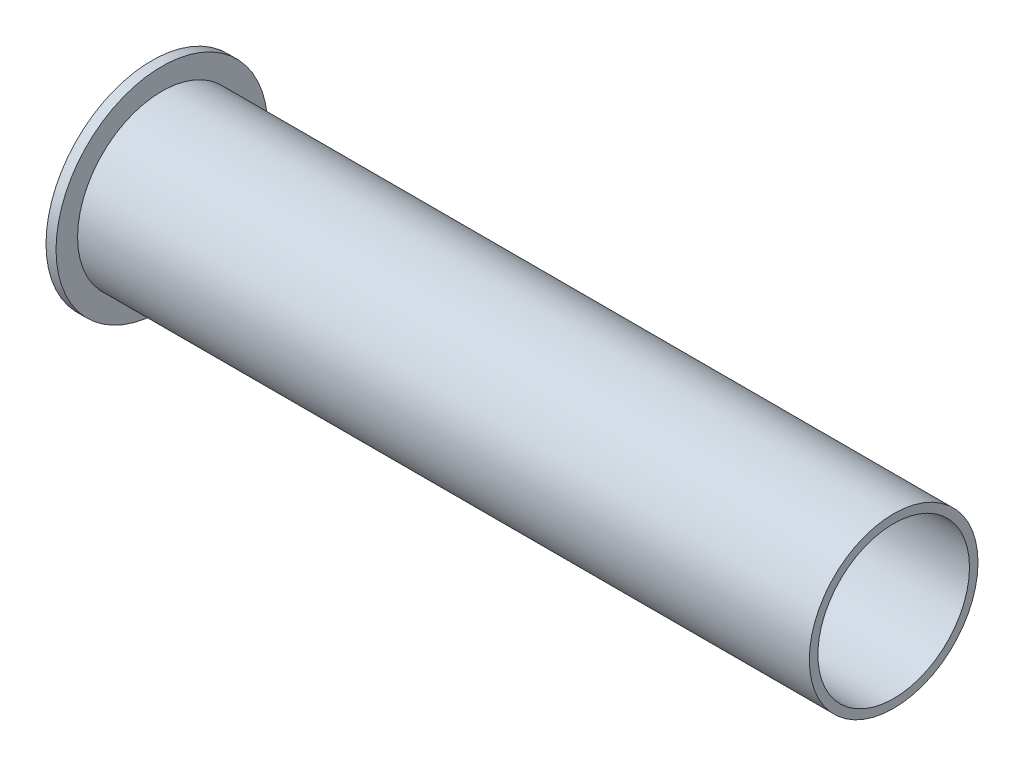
ISO-10303-21;
HEADER;
FILE_DESCRIPTION(('STEP AP214'),'2;1');
FILE_NAME('part.step','',(''),(''),'','','');
FILE_SCHEMA(('AUTOMOTIVE_DESIGN { 1 0 10303 214 1 1 1 1 }'));
ENDSEC;
DATA;
#1=APPLICATION_CONTEXT('core data for automotive mechanical design processes');
#2=APPLICATION_PROTOCOL_DEFINITION('international standard','automotive_design',2000,#1);
#3=PRODUCT_CONTEXT('',#1,'mechanical');
#4=PRODUCT('Part','Part','',(#3));
#5=PRODUCT_RELATED_PRODUCT_CATEGORY('part','',(#4));
#6=PRODUCT_DEFINITION_FORMATION('','',#4);
#7=PRODUCT_DEFINITION_CONTEXT('part definition',#1,'design');
#8=PRODUCT_DEFINITION('design','',#6,#7);
#9=PRODUCT_DEFINITION_SHAPE('','',#8);
#10=(LENGTH_UNIT() NAMED_UNIT(*) SI_UNIT(.MILLI.,.METRE.));
#11=(NAMED_UNIT(*) PLANE_ANGLE_UNIT() SI_UNIT($,.RADIAN.));
#12=(NAMED_UNIT(*) SI_UNIT($,.STERADIAN.) SOLID_ANGLE_UNIT());
#13=UNCERTAINTY_MEASURE_WITH_UNIT(LENGTH_MEASURE(1.E-05),#10,'distance_accuracy_value','');
#14=(GEOMETRIC_REPRESENTATION_CONTEXT(3) GLOBAL_UNCERTAINTY_ASSIGNED_CONTEXT((#13)) GLOBAL_UNIT_ASSIGNED_CONTEXT((#10,
#11,#12)) REPRESENTATION_CONTEXT('',''));
#15=CARTESIAN_POINT('',(0.,0.,0.));
#16=DIRECTION('',(0.,0.,1.));
#17=DIRECTION('',(1.,0.,0.));
#18=AXIS2_PLACEMENT_3D('',#15,#16,#17);
#19=CARTESIAN_POINT('',(56.4134,0.,0.));
#20=DIRECTION('',(-1.,0.,0.));
#21=DIRECTION('',(0.,0.,1.));
#22=AXIS2_PLACEMENT_3D('',#19,#20,#21);
#23=CYLINDRICAL_SURFACE('',#22,6.4135);
#24=CARTESIAN_POINT('',(56.4134,0.,0.));
#25=DIRECTION('',(1.,0.,0.));
#26=DIRECTION('',(0.,0.,-1.));
#27=AXIS2_PLACEMENT_3D('',#24,#25,#26);
#28=CIRCLE('',#27,6.4135);
#29=CARTESIAN_POINT('',(56.4134,0.,-6.4135));
#30=VERTEX_POINT('',#29);
#31=EDGE_CURVE('E36',#30,#30,#28,.T.);
#32=ORIENTED_EDGE('',*,*,#31,.F.);
#33=EDGE_LOOP('',(#32));
#34=FACE_BOUND('',#33,.T.);
#35=CARTESIAN_POINT('',(0.761999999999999,0.,0.));
#36=DIRECTION('',(-1.,0.,0.));
#37=DIRECTION('',(0.,0.,1.));
#38=AXIS2_PLACEMENT_3D('',#35,#36,#37);
#39=CIRCLE('',#38,6.4135);
#40=CARTESIAN_POINT('',(0.761999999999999,0.,6.4135));
#41=VERTEX_POINT('',#40);
#42=EDGE_CURVE('E10',#41,#41,#39,.T.);
#43=ORIENTED_EDGE('',*,*,#42,.F.);
#44=EDGE_LOOP('',(#43));
#45=FACE_BOUND('',#44,.T.);
#46=ADVANCED_FACE('F33',(#34,#45),#23,.T.);
#47=CARTESIAN_POINT('',(56.4134,0.,0.));
#48=DIRECTION('',(1.,0.,0.));
#49=DIRECTION('',(0.,0.,-1.));
#50=AXIS2_PLACEMENT_3D('',#47,#48,#49);
#51=PLANE('',#50);
#52=ORIENTED_EDGE('',*,*,#31,.T.);
#53=EDGE_LOOP('',(#52));
#54=FACE_BOUND('',#53,.T.);
#55=CARTESIAN_POINT('',(56.4134,0.,0.));
#56=DIRECTION('',(1.,0.,0.));
#57=DIRECTION('',(0.,0.,-1.));
#58=AXIS2_PLACEMENT_3D('',#55,#56,#57);
#59=CIRCLE('',#58,5.7658);
#60=CARTESIAN_POINT('',(56.4134,0.,-5.7658));
#61=VERTEX_POINT('',#60);
#62=EDGE_CURVE('E44',#61,#61,#59,.T.);
#63=ORIENTED_EDGE('',*,*,#62,.F.);
#64=EDGE_LOOP('',(#63));
#65=FACE_BOUND('',#64,.T.);
#66=ADVANCED_FACE('F75',(#54,#65),#51,.T.);
#67=CARTESIAN_POINT('',(0.,0.,0.));
#68=DIRECTION('',(1.,0.,0.));
#69=DIRECTION('',(0.,0.,-1.));
#70=AXIS2_PLACEMENT_3D('',#67,#68,#69);
#71=PLANE('',#70);
#72=CARTESIAN_POINT('',(0.,0.,0.));
#73=DIRECTION('',(1.,0.,0.));
#74=DIRECTION('',(0.,0.,-1.));
#75=AXIS2_PLACEMENT_3D('',#72,#73,#74);
#76=CIRCLE('',#75,5.7658);
#77=CARTESIAN_POINT('',(0.,0.,-5.7658));
#78=VERTEX_POINT('',#77);
#79=EDGE_CURVE('E50',#78,#78,#76,.T.);
#80=ORIENTED_EDGE('',*,*,#79,.T.);
#81=EDGE_LOOP('',(#80));
#82=FACE_BOUND('',#81,.T.);
#83=CARTESIAN_POINT('',(0.,0.,0.));
#84=DIRECTION('',(-1.,0.,0.));
#85=DIRECTION('',(0.,0.,1.));
#86=AXIS2_PLACEMENT_3D('',#83,#84,#85);
#87=CIRCLE('',#86,8.0518);
#88=CARTESIAN_POINT('',(0.,0.,8.0518));
#89=VERTEX_POINT('',#88);
#90=EDGE_CURVE('E47',#89,#89,#87,.T.);
#91=ORIENTED_EDGE('',*,*,#90,.T.);
#92=EDGE_LOOP('',(#91));
#93=FACE_BOUND('',#92,.T.);
#94=ADVANCED_FACE('F61',(#82,#93),#71,.F.);
#95=CARTESIAN_POINT('',(56.4134,0.,0.));
#96=DIRECTION('',(-1.,0.,0.));
#97=DIRECTION('',(0.,0.,1.));
#98=AXIS2_PLACEMENT_3D('',#95,#96,#97);
#99=CYLINDRICAL_SURFACE('',#98,5.7658);
#100=ORIENTED_EDGE('',*,*,#79,.F.);
#101=EDGE_LOOP('',(#100));
#102=FACE_BOUND('',#101,.T.);
#103=ORIENTED_EDGE('',*,*,#62,.T.);
#104=EDGE_LOOP('',(#103));
#105=FACE_BOUND('',#104,.T.);
#106=ADVANCED_FACE('F70',(#102,#105),#99,.F.);
#107=CARTESIAN_POINT('',(0.762,0.,0.));
#108=DIRECTION('',(-1.,0.,0.));
#109=DIRECTION('',(0.,0.,1.));
#110=AXIS2_PLACEMENT_3D('',#107,#108,#109);
#111=PLANE('',#110);
#112=CARTESIAN_POINT('',(0.762,0.,0.));
#113=DIRECTION('',(-1.,0.,0.));
#114=DIRECTION('',(0.,0.,1.));
#115=AXIS2_PLACEMENT_3D('',#112,#113,#114);
#116=CIRCLE('',#115,8.0518);
#117=CARTESIAN_POINT('',(0.762,0.,8.0518));
#118=VERTEX_POINT('',#117);
#119=EDGE_CURVE('E52',#118,#118,#116,.T.);
#120=ORIENTED_EDGE('',*,*,#119,.F.);
#121=EDGE_LOOP('',(#120));
#122=FACE_BOUND('',#121,.T.);
#123=ORIENTED_EDGE('',*,*,#42,.T.);
#124=EDGE_LOOP('',(#123));
#125=FACE_BOUND('',#124,.T.);
#126=ADVANCED_FACE('F65',(#122,#125),#111,.F.);
#127=CARTESIAN_POINT('',(0.762,0.,0.));
#128=DIRECTION('',(-1.,0.,0.));
#129=DIRECTION('',(0.,0.,1.));
#130=AXIS2_PLACEMENT_3D('',#127,#128,#129);
#131=CYLINDRICAL_SURFACE('',#130,8.0518);
#132=CARTESIAN_POINT('',(0.762,0.,8.0518));
#133=CARTESIAN_POINT('',(0.7540625,0.,8.0518));
#134=CARTESIAN_POINT('',(0.746125,0.,8.0518));
#135=CARTESIAN_POINT('',(0.73025,0.,8.0518));
#136=CARTESIAN_POINT('',(0.7223125,0.,8.0518));
#137=CARTESIAN_POINT('',(0.7064375,0.,8.0518));
#138=CARTESIAN_POINT('',(0.6985,0.,8.0518));
#139=CARTESIAN_POINT('',(0.682625,0.,8.0518));
#140=CARTESIAN_POINT('',(0.6746875,0.,8.0518));
#141=CARTESIAN_POINT('',(0.6588125,0.,8.0518));
#142=CARTESIAN_POINT('',(0.650875,0.,8.0518));
#143=CARTESIAN_POINT('',(0.635,0.,8.0518));
#144=CARTESIAN_POINT('',(0.6270625,0.,8.0518));
#145=CARTESIAN_POINT('',(0.6111875,0.,8.0518));
#146=CARTESIAN_POINT('',(0.60325,0.,8.0518));
#147=CARTESIAN_POINT('',(0.587375,0.,8.0518));
#148=CARTESIAN_POINT('',(0.5794375,0.,8.0518));
#149=CARTESIAN_POINT('',(0.5635625,0.,8.0518));
#150=CARTESIAN_POINT('',(0.555625,0.,8.0518));
#151=CARTESIAN_POINT('',(0.53975,0.,8.0518));
#152=CARTESIAN_POINT('',(0.5318125,0.,8.0518));
#153=CARTESIAN_POINT('',(0.5159375,0.,8.0518));
#154=CARTESIAN_POINT('',(0.508,0.,8.0518));
#155=CARTESIAN_POINT('',(0.492125,0.,8.0518));
#156=CARTESIAN_POINT('',(0.4841875,0.,8.0518));
#157=CARTESIAN_POINT('',(0.4683125,0.,8.0518));
#158=CARTESIAN_POINT('',(0.460375,0.,8.0518));
#159=CARTESIAN_POINT('',(0.4445,0.,8.0518));
#160=CARTESIAN_POINT('',(0.4365625,0.,8.0518));
#161=CARTESIAN_POINT('',(0.4206875,0.,8.0518));
#162=CARTESIAN_POINT('',(0.41275,0.,8.0518));
#163=CARTESIAN_POINT('',(0.396875,0.,8.0518));
#164=CARTESIAN_POINT('',(0.3889375,0.,8.0518));
#165=CARTESIAN_POINT('',(0.3730625,0.,8.0518));
#166=CARTESIAN_POINT('',(0.365125,0.,8.0518));
#167=CARTESIAN_POINT('',(0.34925,0.,8.0518));
#168=CARTESIAN_POINT('',(0.3413125,0.,8.0518));
#169=CARTESIAN_POINT('',(0.3254375,0.,8.0518));
#170=CARTESIAN_POINT('',(0.3175,0.,8.0518));
#171=CARTESIAN_POINT('',(0.301625,0.,8.0518));
#172=CARTESIAN_POINT('',(0.2936875,0.,8.0518));
#173=CARTESIAN_POINT('',(0.2778125,0.,8.0518));
#174=CARTESIAN_POINT('',(0.269875,0.,8.0518));
#175=CARTESIAN_POINT('',(0.254,0.,8.0518));
#176=CARTESIAN_POINT('',(0.2460625,0.,8.0518));
#177=CARTESIAN_POINT('',(0.2301875,0.,8.0518));
#178=CARTESIAN_POINT('',(0.22225,0.,8.0518));
#179=CARTESIAN_POINT('',(0.206375,0.,8.0518));
#180=CARTESIAN_POINT('',(0.1984375,0.,8.0518));
#181=CARTESIAN_POINT('',(0.1825625,0.,8.0518));
#182=CARTESIAN_POINT('',(0.174625,0.,8.0518));
#183=CARTESIAN_POINT('',(0.15875,0.,8.0518));
#184=CARTESIAN_POINT('',(0.1508125,0.,8.0518));
#185=CARTESIAN_POINT('',(0.1349375,0.,8.0518));
#186=CARTESIAN_POINT('',(0.127,0.,8.0518));
#187=CARTESIAN_POINT('',(0.111125,0.,8.0518));
#188=CARTESIAN_POINT('',(0.1031875,0.,8.0518));
#189=CARTESIAN_POINT('',(0.0873125,0.,8.0518));
#190=CARTESIAN_POINT('',(0.079375,0.,8.0518));
#191=CARTESIAN_POINT('',(0.0635,0.,8.0518));
#192=CARTESIAN_POINT('',(0.0555625,0.,8.0518));
#193=CARTESIAN_POINT('',(0.0396875,0.,8.0518));
#194=CARTESIAN_POINT('',(0.03175,0.,8.0518));
#195=CARTESIAN_POINT('',(0.015875,0.,8.0518));
#196=CARTESIAN_POINT('',(0.00793749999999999,0.,8.0518));
#197=CARTESIAN_POINT('',(0.,0.,8.0518));
#198=B_SPLINE_CURVE_WITH_KNOTS('',3,(#132,#133,#134,#135,#136,#137,#138,#139,#140,#141,#142,
#143,#144,#145,#146,#147,#148,#149,#150,#151,#152,#153,#154,#155,#156,#157,#158,#159,#160,#161,
#162,#163,#164,#165,#166,#167,#168,#169,#170,#171,#172,#173,#174,#175,#176,#177,#178,#179,#180,
#181,#182,#183,#184,#185,#186,#187,#188,#189,#190,#191,#192,#193,#194,#195,#196,#197),
.UNSPECIFIED.,.F.,.F.,(4,2,2,2,2,2,2,2,2,2,2,2,2,2,2,2,2,2,2,2,2,2,2,2,2,2,2,2,2,2,2,2,4),(0.,
0.0238125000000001,0.047625,0.0714375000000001,0.0952500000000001,0.1190625,0.142875,0.1666875,
0.1905,0.2143125,0.238125,0.2619375,0.28575,0.3095625,0.333375,0.3571875,0.381,0.4048125,
0.428625,0.4524375,0.47625,0.5000625,0.523875,0.5476875,0.5715,0.5953125,0.619125,0.6429375,
0.66675,0.6905625,0.714375,0.7381875,0.762),.UNSPECIFIED.);
#199=EDGE_CURVE('BSEAM63',#118,#89,#198,.T.);
#200=ORIENTED_EDGE('',*,*,#119,.T.);
#201=ORIENTED_EDGE('',*,*,#90,.F.);
#202=ORIENTED_EDGE('',*,*,#199,.T.);
#203=ORIENTED_EDGE('',*,*,#199,.F.);
#204=EDGE_LOOP('',(#200,#202,#201,#203));
#205=FACE_BOUND('',#204,.T.);
#206=ADVANCED_FACE('F63',(#205),#131,.T.);
#207=CLOSED_SHELL('',(#46,#66,#94,#106,#126,#206));
#208=MANIFOLD_SOLID_BREP('B2',#207);
#209=ADVANCED_BREP_SHAPE_REPRESENTATION('',(#18,#208),#14);
#210=SHAPE_DEFINITION_REPRESENTATION(#9,#209);
ENDSEC;
END-ISO-10303-21;
